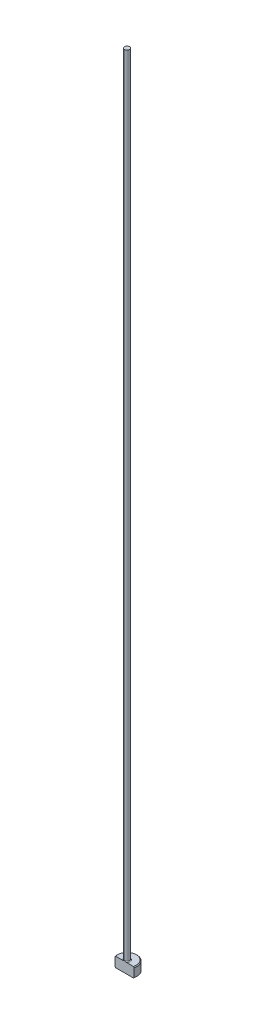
ISO-10303-21;
HEADER;
FILE_DESCRIPTION(('STEP AP214'),'2;1');
FILE_NAME('part.step','',(''),(''),'','','');
FILE_SCHEMA(('AUTOMOTIVE_DESIGN { 1 0 10303 214 1 1 1 1 }'));
ENDSEC;
DATA;
#1=APPLICATION_CONTEXT('core data for automotive mechanical design processes');
#2=APPLICATION_PROTOCOL_DEFINITION('international standard','automotive_design',2000,#1);
#3=PRODUCT_CONTEXT('',#1,'mechanical');
#4=PRODUCT('Part','Part','',(#3));
#5=PRODUCT_RELATED_PRODUCT_CATEGORY('part','',(#4));
#6=PRODUCT_DEFINITION_FORMATION('','',#4);
#7=PRODUCT_DEFINITION_CONTEXT('part definition',#1,'design');
#8=PRODUCT_DEFINITION('design','',#6,#7);
#9=PRODUCT_DEFINITION_SHAPE('','',#8);
#10=(LENGTH_UNIT() NAMED_UNIT(*) SI_UNIT(.MILLI.,.METRE.));
#11=(NAMED_UNIT(*) PLANE_ANGLE_UNIT() SI_UNIT($,.RADIAN.));
#12=(NAMED_UNIT(*) SI_UNIT($,.STERADIAN.) SOLID_ANGLE_UNIT());
#13=UNCERTAINTY_MEASURE_WITH_UNIT(LENGTH_MEASURE(1.E-05),#10,'distance_accuracy_value','');
#14=(GEOMETRIC_REPRESENTATION_CONTEXT(3) GLOBAL_UNCERTAINTY_ASSIGNED_CONTEXT((#13)) GLOBAL_UNIT_ASSIGNED_CONTEXT((#10,
#11,#12)) REPRESENTATION_CONTEXT('',''));
#15=CARTESIAN_POINT('',(0.,0.,0.));
#16=DIRECTION('',(0.,0.,1.));
#17=DIRECTION('',(1.,0.,0.));
#18=AXIS2_PLACEMENT_3D('',#15,#16,#17);
#19=CARTESIAN_POINT('',(0.,0.,0.));
#20=DIRECTION('',(0.,-1.,0.));
#21=DIRECTION('',(0.,0.,-1.));
#22=AXIS2_PLACEMENT_3D('',#19,#20,#21);
#23=PLANE('',#22);
#24=CARTESIAN_POINT('',(0.,0.,0.));
#25=DIRECTION('',(0.,-1.,0.));
#26=DIRECTION('',(0.,0.,-1.));
#27=AXIS2_PLACEMENT_3D('',#24,#25,#26);
#28=CIRCLE('',#27,2.92099999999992);
#29=CARTESIAN_POINT('',(-2.81108554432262,0.,0.793749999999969));
#30=VERTEX_POINT('',#29);
#31=CARTESIAN_POINT('',(2.81108554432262,0.,0.793749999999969));
#32=VERTEX_POINT('',#31);
#33=EDGE_CURVE('E98',#30,#32,#28,.T.);
#34=ORIENTED_EDGE('',*,*,#33,.T.);
#35=DIRECTION('',(-1.,0.,0.));
#36=VECTOR('',#35,1.);
#37=CARTESIAN_POINT('',(-3.07418053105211,0.,0.793749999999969));
#38=LINE('',#37,#36);
#39=EDGE_CURVE('E83',#32,#30,#38,.T.);
#40=ORIENTED_EDGE('',*,*,#39,.T.);
#41=EDGE_LOOP('',(#34,#40));
#42=FACE_BOUND('',#41,.T.);
#43=ADVANCED_FACE('F32',(#42),#23,.T.);
#44=CARTESIAN_POINT('',(0.,259.958771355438,0.));
#45=DIRECTION('',(0.,1.,0.));
#46=DIRECTION('',(0.,0.,1.));
#47=AXIS2_PLACEMENT_3D('',#44,#45,#46);
#48=CYLINDRICAL_SURFACE('',#47,3.17499999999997);
#49=CARTESIAN_POINT('',(0.,2.92100000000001,0.));
#50=DIRECTION('',(0.,1.,0.));
#51=DIRECTION('',(0.,0.,1.));
#52=AXIS2_PLACEMENT_3D('',#49,#50,#51);
#53=CIRCLE('',#52,3.17499999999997);
#54=CARTESIAN_POINT('',(-3.07418053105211,2.92100000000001,0.793749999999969));
#55=VERTEX_POINT('',#54);
#56=CARTESIAN_POINT('',(3.07418053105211,2.92100000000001,0.793749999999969));
#57=VERTEX_POINT('',#56);
#58=EDGE_CURVE('E104',#55,#57,#53,.F.);
#59=ORIENTED_EDGE('',*,*,#58,.T.);
#60=DIRECTION('',(0.,-1.,0.));
#61=VECTOR('',#60,1.);
#62=CARTESIAN_POINT('',(3.07418053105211,254.,0.793749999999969));
#63=LINE('',#62,#61);
#64=CARTESIAN_POINT('',(3.07418053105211,0.254000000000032,0.793749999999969));
#65=VERTEX_POINT('',#64);
#66=EDGE_CURVE('E183',#57,#65,#63,.T.);
#67=ORIENTED_EDGE('',*,*,#66,.T.);
#68=CARTESIAN_POINT('',(0.,0.254000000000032,0.));
#69=DIRECTION('',(0.,-1.,0.));
#70=DIRECTION('',(0.,0.,-1.));
#71=AXIS2_PLACEMENT_3D('',#68,#69,#70);
#72=CIRCLE('',#71,3.17499999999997);
#73=CARTESIAN_POINT('',(-3.07418053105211,0.254000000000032,0.793749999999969));
#74=VERTEX_POINT('',#73);
#75=EDGE_CURVE('E100',#65,#74,#72,.F.);
#76=ORIENTED_EDGE('',*,*,#75,.T.);
#77=DIRECTION('',(0.,-1.,0.));
#78=VECTOR('',#77,1.);
#79=CARTESIAN_POINT('',(-3.07418053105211,254.,0.793749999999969));
#80=LINE('',#79,#78);
#81=EDGE_CURVE('E93',#55,#74,#80,.T.);
#82=ORIENTED_EDGE('',*,*,#81,.F.);
#83=EDGE_LOOP('',(#59,#67,#76,#82));
#84=FACE_BOUND('',#83,.T.);
#85=ADVANCED_FACE('F158',(#84),#48,.T.);
#86=CARTESIAN_POINT('',(-3.17499999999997,3.175,0.));
#87=DIRECTION('',(0.,1.,0.));
#88=DIRECTION('',(0.,0.,1.));
#89=AXIS2_PLACEMENT_3D('',#86,#87,#88);
#90=PLANE('',#89);
#91=CARTESIAN_POINT('',(0.,3.175,0.));
#92=DIRECTION('',(0.,1.,0.));
#93=DIRECTION('',(0.,0.,1.));
#94=AXIS2_PLACEMENT_3D('',#91,#92,#93);
#95=CIRCLE('',#94,2.92099999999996);
#96=CARTESIAN_POINT('',(2.81108554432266,3.175,0.793749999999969));
#97=VERTEX_POINT('',#96);
#98=CARTESIAN_POINT('',(-2.81108554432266,3.175,0.793749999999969));
#99=VERTEX_POINT('',#98);
#100=EDGE_CURVE('E178',#97,#99,#95,.T.);
#101=ORIENTED_EDGE('',*,*,#100,.T.);
#102=DIRECTION('',(1.,0.,0.));
#103=VECTOR('',#102,1.);
#104=CARTESIAN_POINT('',(-3.17499999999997,3.175,0.793749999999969));
#105=LINE('',#104,#103);
#106=CARTESIAN_POINT('',(-0.68391593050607,3.17500000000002,0.793749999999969));
#107=VERTEX_POINT('',#106);
#108=EDGE_CURVE('E57',#99,#107,#105,.T.);
#109=ORIENTED_EDGE('',*,*,#108,.T.);
#110=CARTESIAN_POINT('',(0.,3.175,0.));
#111=DIRECTION('',(0.,1.,0.));
#112=DIRECTION('',(0.,0.,1.));
#113=AXIS2_PLACEMENT_3D('',#110,#111,#112);
#114=CIRCLE('',#113,1.04774999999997);
#115=CARTESIAN_POINT('',(0.683915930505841,3.17500000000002,0.793749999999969));
#116=VERTEX_POINT('',#115);
#117=EDGE_CURVE('E107',#107,#116,#114,.F.);
#118=ORIENTED_EDGE('',*,*,#117,.T.);
#119=EDGE_CURVE('E136',#116,#97,#105,.T.);
#120=ORIENTED_EDGE('',*,*,#119,.T.);
#121=EDGE_LOOP('',(#101,#109,#118,#120));
#122=FACE_BOUND('',#121,.T.);
#123=ADVANCED_FACE('F147',(#122),#90,.T.);
#124=CARTESIAN_POINT('',(0.,3.17499999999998,0.));
#125=DIRECTION('',(0.,-1.,0.));
#126=DIRECTION('',(0.,0.,-1.));
#127=AXIS2_PLACEMENT_3D('',#124,#125,#126);
#128=CONICAL_SURFACE('',#127,2.92099999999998,0.785398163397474);
#129=ORIENTED_EDGE('',*,*,#58,.F.);
#130=CARTESIAN_POINT('',(-6.76654378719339,-0.71694017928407,0.793749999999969));
#131=CARTESIAN_POINT('',(-6.58612847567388,-0.537757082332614,0.793749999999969));
#132=CARTESIAN_POINT('',(-6.40566799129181,-0.358619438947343,0.793749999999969));
#133=CARTESIAN_POINT('',(-6.0445852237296,-0.000434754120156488,0.793749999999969));
#134=CARTESIAN_POINT('',(-5.86396291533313,0.178612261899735,0.793749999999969));
#135=CARTESIAN_POINT('',(-5.50181071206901,0.537283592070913,0.793749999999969));
#136=CARTESIAN_POINT('',(-5.32028015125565,0.716907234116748,0.793749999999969));
#137=CARTESIAN_POINT('',(-4.9570333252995,1.07589430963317,0.793749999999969));
#138=CARTESIAN_POINT('',(-4.77531710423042,1.25525778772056,0.793749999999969));
#139=CARTESIAN_POINT('',(-4.30046081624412,1.72319332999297,0.793749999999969));
#140=CARTESIAN_POINT('',(-4.00708464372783,2.01152633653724,0.793749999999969));
#141=CARTESIAN_POINT('',(-3.56582498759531,2.44302479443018,0.793749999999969));
#142=CARTESIAN_POINT('',(-3.41848369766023,2.58674450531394,0.793749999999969));
#143=CARTESIAN_POINT('',(-3.12328201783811,2.87362456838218,0.793749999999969));
#144=CARTESIAN_POINT('',(-2.97542167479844,3.01678496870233,0.793749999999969));
#145=CARTESIAN_POINT('',(-2.67948713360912,3.30170246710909,0.793749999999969));
#146=CARTESIAN_POINT('',(-2.53141613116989,3.44346288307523,0.793749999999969));
#147=CARTESIAN_POINT('',(-2.23395385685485,3.72569854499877,0.793749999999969));
#148=CARTESIAN_POINT('',(-2.08456216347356,3.86617334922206,0.793749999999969));
#149=CARTESIAN_POINT('',(-1.85887536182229,4.0749451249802,0.793749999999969));
#150=CARTESIAN_POINT('',(-1.7834340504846,4.14416382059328,0.793749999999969));
#151=CARTESIAN_POINT('',(-1.63175147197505,4.28171769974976,0.793749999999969));
#152=CARTESIAN_POINT('',(-1.55551023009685,4.35005291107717,0.793749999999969));
#153=CARTESIAN_POINT('',(-1.40191671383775,4.48538182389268,0.793749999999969));
#154=CARTESIAN_POINT('',(-1.32456505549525,4.55237622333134,0.793749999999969));
#155=CARTESIAN_POINT('',(-1.168148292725,4.68432749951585,0.793749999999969));
#156=CARTESIAN_POINT('',(-1.08908357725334,4.74928483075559,0.793749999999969));
#157=CARTESIAN_POINT('',(-0.978646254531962,4.83605857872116,0.793749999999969));
#158=CARTESIAN_POINT('',(-0.948460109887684,4.85938268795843,0.793749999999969));
#159=CARTESIAN_POINT('',(-0.887614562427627,4.90541183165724,0.793749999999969));
#160=CARTESIAN_POINT('',(-0.856955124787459,4.92811682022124,0.793749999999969));
#161=CARTESIAN_POINT('',(-0.794984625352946,4.97280020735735,0.793749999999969));
#162=CARTESIAN_POINT('',(-0.763672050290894,4.99477651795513,0.793749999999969));
#163=CARTESIAN_POINT('',(-0.700352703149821,5.03770392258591,0.793749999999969));
#164=CARTESIAN_POINT('',(-0.66834596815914,5.05865507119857,0.793749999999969));
#165=CARTESIAN_POINT('',(-0.60459623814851,5.09851389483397,0.793749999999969));
#166=CARTESIAN_POINT('',(-0.57288224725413,5.11746713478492,0.793749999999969));
#167=CARTESIAN_POINT('',(-0.508518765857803,5.15370377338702,0.793749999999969));
#168=CARTESIAN_POINT('',(-0.475868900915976,5.17098649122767,0.793749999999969));
#169=CARTESIAN_POINT('',(-0.376526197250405,5.21937397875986,0.793749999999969));
#170=CARTESIAN_POINT('',(-0.308073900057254,5.24726182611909,0.793749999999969));
#171=CARTESIAN_POINT('',(-0.214532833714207,5.27405975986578,0.793749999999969));
#172=CARTESIAN_POINT('',(-0.191393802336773,5.27981785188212,0.793749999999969));
#173=CARTESIAN_POINT('',(-0.144729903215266,5.28948827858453,0.793749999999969));
#174=CARTESIAN_POINT('',(-0.121204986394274,5.29340037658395,0.793749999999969));
#175=CARTESIAN_POINT('',(-0.050413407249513,5.30201256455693,0.793749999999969));
#176=CARTESIAN_POINT('',(-0.00272310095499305,5.3036512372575,0.793749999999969));
#177=CARTESIAN_POINT('',(0.092081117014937,5.2983358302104,0.793749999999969));
#178=CARTESIAN_POINT('',(0.139195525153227,5.29138976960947,0.793749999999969));
#179=CARTESIAN_POINT('',(0.231925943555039,5.27030742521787,0.793749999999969));
#180=CARTESIAN_POINT('',(0.277534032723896,5.25613809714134,0.793749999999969));
#181=CARTESIAN_POINT('',(0.379024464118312,5.21798849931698,0.793749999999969));
#182=CARTESIAN_POINT('',(0.434273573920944,5.19238048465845,0.793749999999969));
#183=CARTESIAN_POINT('',(0.542067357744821,5.13591410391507,0.793749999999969));
#184=CARTESIAN_POINT('',(0.594605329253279,5.10504346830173,0.793749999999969));
#185=CARTESIAN_POINT('',(0.697964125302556,5.03978970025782,0.793749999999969));
#186=CARTESIAN_POINT('',(0.748769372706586,5.00538227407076,0.793749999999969));
#187=CARTESIAN_POINT('',(0.848768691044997,4.93444453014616,0.793749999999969));
#188=CARTESIAN_POINT('',(0.897964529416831,4.89791667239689,0.793749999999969));
#189=CARTESIAN_POINT('',(1.00110200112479,4.8188872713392,0.793749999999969));
#190=CARTESIAN_POINT('',(1.05489843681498,4.77619738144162,0.793749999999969));
#191=CARTESIAN_POINT('',(1.1614670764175,4.68955385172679,0.793749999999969));
#192=CARTESIAN_POINT('',(1.21423916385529,4.6456000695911,0.793749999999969));
#193=CARTESIAN_POINT('',(1.37147314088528,4.51238432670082,0.793749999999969));
#194=CARTESIAN_POINT('',(1.47481171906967,4.42180042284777,0.793749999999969));
#195=CARTESIAN_POINT('',(1.67990723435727,4.23856991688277,0.793749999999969));
#196=CARTESIAN_POINT('',(1.78166152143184,4.14592038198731,0.793749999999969));
#197=CARTESIAN_POINT('',(1.9840360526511,3.95943864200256,0.793749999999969));
#198=CARTESIAN_POINT('',(2.08465655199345,3.8656067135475,0.793749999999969));
#199=CARTESIAN_POINT('',(2.28470036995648,3.67758310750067,0.793749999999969));
#200=CARTESIAN_POINT('',(2.38412704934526,3.58339499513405,0.793749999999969));
#201=CARTESIAN_POINT('',(2.58246726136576,3.39446890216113,0.793749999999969));
#202=CARTESIAN_POINT('',(2.68138076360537,3.29973088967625,0.793749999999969));
#203=CARTESIAN_POINT('',(2.97740330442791,3.01509017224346,0.793749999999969));
#204=CARTESIAN_POINT('',(3.17395519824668,2.82460855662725,0.793749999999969));
#205=CARTESIAN_POINT('',(3.65457059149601,2.35679110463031,0.793749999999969));
#206=CARTESIAN_POINT('',(3.93817207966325,2.07898169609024,0.793749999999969));
#207=CARTESIAN_POINT('',(4.50454370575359,1.52234859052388,0.793749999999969));
#208=CARTESIAN_POINT('',(4.78731356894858,1.24352461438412,0.793749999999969));
#209=CARTESIAN_POINT('',(5.35306828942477,0.684582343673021,0.793749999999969));
#210=CARTESIAN_POINT('',(5.6360516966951,0.404462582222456,0.793749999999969));
#211=CARTESIAN_POINT('',(6.20156797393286,-0.156054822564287,0.793749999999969));
#212=CARTESIAN_POINT('',(6.48410095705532,-0.436452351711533,0.793749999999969));
#213=CARTESIAN_POINT('',(6.76654378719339,-0.71694017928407,0.793749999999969));
#214=B_SPLINE_CURVE_WITH_KNOTS('',3,(#130,#131,#132,#133,#134,#135,#136,#137,#138,#139,#140,
#141,#142,#143,#144,#145,#146,#147,#148,#149,#150,#151,#152,#153,#154,#155,#156,#157,#158,#159,
#160,#161,#162,#163,#164,#165,#166,#167,#168,#169,#170,#171,#172,#173,#174,#175,#176,#177,#178,
#179,#180,#181,#182,#183,#184,#185,#186,#187,#188,#189,#190,#191,#192,#193,#194,#195,#196,#197,
#198,#199,#200,#201,#202,#203,#204,#205,#206,#207,#208,#209,#210,#211,#212,#213),.UNSPECIFIED.,
.F.,.F.,(4,2,2,2,2,2,2,2,2,2,2,2,2,2,2,2,2,2,2,2,2,2,2,2,2,2,2,2,2,2,2,2,2,2,2,2,2,2,2,2,2,4),
(0.,0.762827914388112,1.5258090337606,2.29194326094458,3.05792523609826,4.29195946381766,
4.90944009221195,5.52686635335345,6.14183419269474,6.75700594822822,7.06415568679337,
7.37129574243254,7.67827152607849,7.98517832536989,8.09961411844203,8.21405837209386,
8.32880631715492,8.44354814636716,8.5543309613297,8.66515873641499,8.88549900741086,
8.95696802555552,9.0284462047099,9.17076254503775,9.3129460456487,9.45578590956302,
9.63799856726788,9.82064200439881,10.0046365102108,10.1884216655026,10.3944233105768,
10.6004482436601,11.0126549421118,11.4254897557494,11.8382297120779,12.2490965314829,
12.6599874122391,13.4811048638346,14.6720966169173,15.8634454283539,17.0579826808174,
18.2521466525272),.UNSPECIFIED.);
#215=EDGE_CURVE('E135',#55,#99,#214,.T.);
#216=ORIENTED_EDGE('',*,*,#215,.T.);
#217=ORIENTED_EDGE('',*,*,#100,.F.);
#218=EDGE_CURVE('E127',#97,#57,#214,.T.);
#219=ORIENTED_EDGE('',*,*,#218,.T.);
#220=EDGE_LOOP('',(#129,#216,#217,#219));
#221=FACE_BOUND('',#220,.T.);
#222=ADVANCED_FACE('F143',(#221),#128,.T.);
#223=CARTESIAN_POINT('',(0.,0.254000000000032,0.));
#224=DIRECTION('',(0.,1.,0.));
#225=DIRECTION('',(0.,0.,1.));
#226=AXIS2_PLACEMENT_3D('',#223,#224,#225);
#227=CONICAL_SURFACE('',#226,3.17499999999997,0.785398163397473);
#228=ORIENTED_EDGE('',*,*,#75,.F.);
#229=CARTESIAN_POINT('',(6.76654378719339,3.89194017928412,0.793749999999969));
#230=CARTESIAN_POINT('',(6.58612847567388,3.71275708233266,0.793749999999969));
#231=CARTESIAN_POINT('',(6.4056679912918,3.53361943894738,0.793749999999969));
#232=CARTESIAN_POINT('',(6.04458522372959,3.17543475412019,0.793749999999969));
#233=CARTESIAN_POINT('',(5.86396291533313,2.9963877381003,0.793749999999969));
#234=CARTESIAN_POINT('',(5.501810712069,2.63771640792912,0.793749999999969));
#235=CARTESIAN_POINT('',(5.32028015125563,2.45809276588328,0.793749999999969));
#236=CARTESIAN_POINT('',(4.95703332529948,2.09910569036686,0.793749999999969));
#237=CARTESIAN_POINT('',(4.7753171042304,1.91974221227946,0.793749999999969));
#238=CARTESIAN_POINT('',(4.3004608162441,1.45180667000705,0.793749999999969));
#239=CARTESIAN_POINT('',(4.00708464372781,1.16347366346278,0.793749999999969));
#240=CARTESIAN_POINT('',(3.56582498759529,0.731975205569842,0.793749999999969));
#241=CARTESIAN_POINT('',(3.41848369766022,0.58825549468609,0.793749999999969));
#242=CARTESIAN_POINT('',(3.1232820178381,0.301375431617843,0.793749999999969));
#243=CARTESIAN_POINT('',(2.97542167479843,0.158215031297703,0.793749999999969));
#244=CARTESIAN_POINT('',(2.67948713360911,-0.12670246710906,0.793749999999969));
#245=CARTESIAN_POINT('',(2.53141613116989,-0.268462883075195,0.793749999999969));
#246=CARTESIAN_POINT('',(2.23395385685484,-0.55069854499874,0.793749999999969));
#247=CARTESIAN_POINT('',(2.08456216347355,-0.691173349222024,0.793749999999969));
#248=CARTESIAN_POINT('',(1.85887536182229,-0.899945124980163,0.793749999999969));
#249=CARTESIAN_POINT('',(1.7834340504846,-0.969163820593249,0.793749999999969));
#250=CARTESIAN_POINT('',(1.63175147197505,-1.10671769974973,0.793749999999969));
#251=CARTESIAN_POINT('',(1.55551023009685,-1.17505291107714,0.793749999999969));
#252=CARTESIAN_POINT('',(1.40191671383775,-1.31038182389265,0.793749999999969));
#253=CARTESIAN_POINT('',(1.32456505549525,-1.3773762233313,0.793749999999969));
#254=CARTESIAN_POINT('',(1.168148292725,-1.50932749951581,0.793749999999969));
#255=CARTESIAN_POINT('',(1.08908357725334,-1.57428483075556,0.793749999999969));
#256=CARTESIAN_POINT('',(0.978646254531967,-1.66105857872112,0.793749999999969));
#257=CARTESIAN_POINT('',(0.948460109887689,-1.68438268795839,0.793749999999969));
#258=CARTESIAN_POINT('',(0.887614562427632,-1.7304118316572,0.793749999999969));
#259=CARTESIAN_POINT('',(0.856955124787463,-1.7531168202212,0.793749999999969));
#260=CARTESIAN_POINT('',(0.79498462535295,-1.79780020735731,0.793749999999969));
#261=CARTESIAN_POINT('',(0.763672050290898,-1.81977651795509,0.793749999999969));
#262=CARTESIAN_POINT('',(0.700352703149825,-1.86270392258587,0.793749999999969));
#263=CARTESIAN_POINT('',(0.668345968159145,-1.88365507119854,0.793749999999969));
#264=CARTESIAN_POINT('',(0.604596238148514,-1.92351389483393,0.793749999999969));
#265=CARTESIAN_POINT('',(0.572882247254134,-1.94246713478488,0.793749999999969));
#266=CARTESIAN_POINT('',(0.508518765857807,-1.97870377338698,0.793749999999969));
#267=CARTESIAN_POINT('',(0.47586890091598,-1.99598649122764,0.793749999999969));
#268=CARTESIAN_POINT('',(0.37652619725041,-2.04437397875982,0.793749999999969));
#269=CARTESIAN_POINT('',(0.30807390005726,-2.07226182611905,0.793749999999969));
#270=CARTESIAN_POINT('',(0.214532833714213,-2.09905975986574,0.793749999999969));
#271=CARTESIAN_POINT('',(0.191393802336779,-2.10481785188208,0.793749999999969));
#272=CARTESIAN_POINT('',(0.144729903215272,-2.11448827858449,0.793749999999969));
#273=CARTESIAN_POINT('',(0.12120498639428,-2.11840037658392,0.793749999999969));
#274=CARTESIAN_POINT('',(0.050413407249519,-2.12701256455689,0.793749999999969));
#275=CARTESIAN_POINT('',(0.00272310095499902,-2.12865123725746,0.793749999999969));
#276=CARTESIAN_POINT('',(-0.0920811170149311,-2.12333583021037,0.793749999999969));
#277=CARTESIAN_POINT('',(-0.139195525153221,-2.11638976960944,0.793749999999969));
#278=CARTESIAN_POINT('',(-0.231925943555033,-2.09530742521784,0.793749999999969));
#279=CARTESIAN_POINT('',(-0.27753403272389,-2.08113809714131,0.793749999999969));
#280=CARTESIAN_POINT('',(-0.379024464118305,-2.04298849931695,0.793749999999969));
#281=CARTESIAN_POINT('',(-0.434273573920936,-2.01738048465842,0.793749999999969));
#282=CARTESIAN_POINT('',(-0.542067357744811,-1.96091410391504,0.793749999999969));
#283=CARTESIAN_POINT('',(-0.594605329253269,-1.9300434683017,0.793749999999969));
#284=CARTESIAN_POINT('',(-0.697964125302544,-1.86478970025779,0.793749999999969));
#285=CARTESIAN_POINT('',(-0.748769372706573,-1.83038227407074,0.793749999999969));
#286=CARTESIAN_POINT('',(-0.848768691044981,-1.75944453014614,0.793749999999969));
#287=CARTESIAN_POINT('',(-0.897964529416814,-1.72291667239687,0.793749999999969));
#288=CARTESIAN_POINT('',(-1.00110200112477,-1.64388727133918,0.793749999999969));
#289=CARTESIAN_POINT('',(-1.05489843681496,-1.60119738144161,0.793749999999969));
#290=CARTESIAN_POINT('',(-1.16146707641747,-1.51455385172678,0.793749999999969));
#291=CARTESIAN_POINT('',(-1.21423916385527,-1.47060006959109,0.793749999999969));
#292=CARTESIAN_POINT('',(-1.37147314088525,-1.33738432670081,0.793749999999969));
#293=CARTESIAN_POINT('',(-1.47481171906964,-1.24680042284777,0.793749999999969));
#294=CARTESIAN_POINT('',(-1.67990723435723,-1.06356991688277,0.793749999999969));
#295=CARTESIAN_POINT('',(-1.7816615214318,-0.970920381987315,0.793749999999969));
#296=CARTESIAN_POINT('',(-1.98403605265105,-0.784438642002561,0.793749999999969));
#297=CARTESIAN_POINT('',(-2.0846565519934,-0.690606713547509,0.793749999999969));
#298=CARTESIAN_POINT('',(-2.28470036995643,-0.502583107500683,0.793749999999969));
#299=CARTESIAN_POINT('',(-2.38412704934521,-0.408394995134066,0.793749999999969));
#300=CARTESIAN_POINT('',(-2.5824672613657,-0.219468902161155,0.793749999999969));
#301=CARTESIAN_POINT('',(-2.68138076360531,-0.124730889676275,0.793749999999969));
#302=CARTESIAN_POINT('',(-2.97740330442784,0.159909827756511,0.793749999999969));
#303=CARTESIAN_POINT('',(-3.17395519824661,0.350391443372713,0.793749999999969));
#304=CARTESIAN_POINT('',(-3.65457059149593,0.818208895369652,0.793749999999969));
#305=CARTESIAN_POINT('',(-3.93817207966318,1.09601830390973,0.793749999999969));
#306=CARTESIAN_POINT('',(-4.50454370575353,1.65265140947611,0.793749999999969));
#307=CARTESIAN_POINT('',(-4.78731356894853,1.93147538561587,0.793749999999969));
#308=CARTESIAN_POINT('',(-5.35306828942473,2.49041765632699,0.793749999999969));
#309=CARTESIAN_POINT('',(-5.63605169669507,2.77053741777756,0.793749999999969));
#310=CARTESIAN_POINT('',(-6.20156797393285,3.33105482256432,0.793749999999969));
#311=CARTESIAN_POINT('',(-6.48410095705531,3.61145235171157,0.793749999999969));
#312=CARTESIAN_POINT('',(-6.76654378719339,3.89194017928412,0.793749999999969));
#313=B_SPLINE_CURVE_WITH_KNOTS('',3,(#229,#230,#231,#232,#233,#234,#235,#236,#237,#238,#239,
#240,#241,#242,#243,#244,#245,#246,#247,#248,#249,#250,#251,#252,#253,#254,#255,#256,#257,#258,
#259,#260,#261,#262,#263,#264,#265,#266,#267,#268,#269,#270,#271,#272,#273,#274,#275,#276,#277,
#278,#279,#280,#281,#282,#283,#284,#285,#286,#287,#288,#289,#290,#291,#292,#293,#294,#295,#296,
#297,#298,#299,#300,#301,#302,#303,#304,#305,#306,#307,#308,#309,#310,#311,#312),.UNSPECIFIED.,
.F.,.F.,(4,2,2,2,2,2,2,2,2,2,2,2,2,2,2,2,2,2,2,2,2,2,2,2,2,2,2,2,2,2,2,2,2,2,2,2,2,2,2,2,2,4),
(0.,0.762827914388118,1.52580903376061,2.29194326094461,3.05792523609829,4.29195946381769,
4.90944009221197,5.52686635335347,6.14183419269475,6.75700594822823,7.06415568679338,
7.37129574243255,7.6782715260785,7.98517832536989,8.09961411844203,8.21405837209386,
8.32880631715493,8.44354814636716,8.5543309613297,8.665158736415,8.88549900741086,
8.95696802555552,9.0284462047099,9.17076254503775,9.3129460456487,9.45578590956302,
9.63799856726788,9.8206420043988,10.0046365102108,10.1884216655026,10.3944233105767,
10.6004482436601,11.0126549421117,11.4254897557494,11.8382297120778,12.2490965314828,
12.6599874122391,13.4811048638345,14.6720966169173,15.8634454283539,17.0579826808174,
18.2521466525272),.UNSPECIFIED.);
#314=EDGE_CURVE('E86',#65,#32,#313,.T.);
#315=ORIENTED_EDGE('',*,*,#314,.T.);
#316=ORIENTED_EDGE('',*,*,#33,.F.);
#317=EDGE_CURVE('E89',#30,#74,#313,.T.);
#318=ORIENTED_EDGE('',*,*,#317,.T.);
#319=EDGE_LOOP('',(#228,#315,#316,#318));
#320=FACE_BOUND('',#319,.T.);
#321=ADVANCED_FACE('F97',(#320),#227,.T.);
#322=CARTESIAN_POINT('',(0.,3.42900000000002,0.));
#323=DIRECTION('',(0.,1.,0.));
#324=DIRECTION('',(0.,0.,1.));
#325=AXIS2_PLACEMENT_3D('',#322,#323,#324);
#326=TOROIDAL_SURFACE('',#325,1.04774999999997,0.254);
#327=CARTESIAN_POINT('',(0.,3.42900000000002,0.793749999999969));
#328=CARTESIAN_POINT('',(1.00594079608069E-09,3.42900059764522,0.793749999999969));
#329=CARTESIAN_POINT('',(8.25543157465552E-08,3.42900119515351,0.793749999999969));
#330=CARTESIAN_POINT('',(3.59845202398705E-07,3.42900236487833,0.793749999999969));
#331=CARTESIAN_POINT('',(5.56611928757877E-07,3.42900293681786,0.793749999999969));
#332=CARTESIAN_POINT('',(1.03793284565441E-06,3.4290040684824,0.793749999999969));
#333=CARTESIAN_POINT('',(1.32565590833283E-06,3.42900462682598,0.793749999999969));
#334=CARTESIAN_POINT('',(1.96199956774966E-06,3.42900570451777,0.793749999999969));
#335=CARTESIAN_POINT('',(2.31046733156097E-06,3.42900622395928,0.793749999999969));
#336=CARTESIAN_POINT('',(3.51238455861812E-06,3.42900787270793,0.793749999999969));
#337=CARTESIAN_POINT('',(4.44738387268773E-06,3.42900894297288,0.793749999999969));
#338=CARTESIAN_POINT('',(6.43338758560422E-06,3.42901092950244,0.793749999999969));
#339=CARTESIAN_POINT('',(7.48242245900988E-06,3.42901184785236,0.793749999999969));
#340=CARTESIAN_POINT('',(1.1352686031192E-05,3.42901504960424,0.793749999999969));
#341=CARTESIAN_POINT('',(1.43190067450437E-05,3.42901716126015,0.793749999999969));
#342=CARTESIAN_POINT('',(2.0344879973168E-05,3.42902083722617,0.793749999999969));
#343=CARTESIAN_POINT('',(2.33909441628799E-05,3.42902242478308,0.793749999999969));
#344=CARTESIAN_POINT('',(3.56627691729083E-05,3.42902869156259,0.793749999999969));
#345=CARTESIAN_POINT('',(4.4989192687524E-05,3.42903316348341,0.793749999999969));
#346=CARTESIAN_POINT('',(6.2853777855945E-05,3.42904079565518,0.793749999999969));
#347=CARTESIAN_POINT('',(7.13510645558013E-05,3.42904404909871,0.793749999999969));
#348=CARTESIAN_POINT('',(0.000129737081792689,3.42906834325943,0.793749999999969));
#349=CARTESIAN_POINT('',(0.00017577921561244,3.42909753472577,0.793749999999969));
#350=CARTESIAN_POINT('',(0.000350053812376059,3.42920359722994,0.793749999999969));
#351=CARTESIAN_POINT('',(0.00048099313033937,3.42927442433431,0.793749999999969));
#352=CARTESIAN_POINT('',(0.000972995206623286,3.42954494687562,0.793749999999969));
#353=CARTESIAN_POINT('',(0.00133127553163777,3.4297509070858,0.793749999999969));
#354=CARTESIAN_POINT('',(0.00275914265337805,3.43056728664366,0.793749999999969));
#355=CARTESIAN_POINT('',(0.00383182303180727,3.43117068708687,0.793749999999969));
#356=CARTESIAN_POINT('',(0.0249852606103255,3.44307504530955,0.793749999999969));
#357=CARTESIAN_POINT('',(0.0450341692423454,3.45445024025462,0.793749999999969));
#358=CARTESIAN_POINT('',(0.0846093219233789,3.47663493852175,0.793749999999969));
#359=CARTESIAN_POINT('',(0.10413206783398,3.48745096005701,0.793749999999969));
#360=CARTESIAN_POINT('',(0.145314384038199,3.50987127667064,0.793749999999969));
#361=CARTESIAN_POINT('',(0.166990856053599,3.52144503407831,0.793749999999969));
#362=CARTESIAN_POINT('',(0.210829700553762,3.54412234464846,0.793749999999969));
#363=CARTESIAN_POINT('',(0.232994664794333,3.55522089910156,0.793749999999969));
#364=CARTESIAN_POINT('',(0.289745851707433,3.58237702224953,0.793749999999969));
#365=CARTESIAN_POINT('',(0.324598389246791,3.59788963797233,0.793749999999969));
#366=CARTESIAN_POINT('',(0.394732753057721,3.62578193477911,0.793749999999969));
#367=CARTESIAN_POINT('',(0.429990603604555,3.63822002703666,0.793749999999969));
#368=CARTESIAN_POINT('',(0.486020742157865,3.65466140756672,0.793749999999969));
#369=CARTESIAN_POINT('',(0.506403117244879,3.65997735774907,0.793749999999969));
#370=CARTESIAN_POINT('',(0.547581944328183,3.66916489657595,0.793749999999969));
#371=CARTESIAN_POINT('',(0.568379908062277,3.67302947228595,0.793749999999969));
#372=CARTESIAN_POINT('',(0.632823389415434,3.68222555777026,0.793749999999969));
#373=CARTESIAN_POINT('',(0.677005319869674,3.6846711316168,0.793749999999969));
#374=CARTESIAN_POINT('',(0.74175190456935,3.68045811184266,0.793749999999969));
#375=CARTESIAN_POINT('',(0.762598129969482,3.67788777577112,0.793749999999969));
#376=CARTESIAN_POINT('',(0.803620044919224,3.66996519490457,0.793749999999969));
#377=CARTESIAN_POINT('',(0.823799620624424,3.66463419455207,0.793749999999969));
#378=CARTESIAN_POINT('',(0.863382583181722,3.65071566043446,0.793749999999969));
#379=CARTESIAN_POINT('',(0.882769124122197,3.64207900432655,0.793749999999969));
#380=CARTESIAN_POINT('',(0.919550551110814,3.62121223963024,0.793749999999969));
#381=CARTESIAN_POINT('',(0.936947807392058,3.6089864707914,0.793749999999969));
#382=CARTESIAN_POINT('',(0.962807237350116,3.5859668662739,0.793749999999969));
#383=CARTESIAN_POINT('',(0.972229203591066,3.57624640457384,0.793749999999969));
#384=CARTESIAN_POINT('',(0.989372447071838,3.55540033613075,0.793749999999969));
#385=CARTESIAN_POINT('',(0.997095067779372,3.54427585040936,0.793749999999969));
#386=CARTESIAN_POINT('',(1.01049428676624,3.52073386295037,0.793749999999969));
#387=CARTESIAN_POINT('',(1.01615519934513,3.50830733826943,0.793749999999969));
#388=CARTESIAN_POINT('',(1.02498233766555,3.48259444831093,0.793749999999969));
#389=CARTESIAN_POINT('',(1.02815025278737,3.46930867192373,0.793749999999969));
#390=CARTESIAN_POINT('',(1.03155096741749,3.44397291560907,0.793749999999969));
#391=CARTESIAN_POINT('',(1.03208709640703,3.43196305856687,0.793749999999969));
#392=CARTESIAN_POINT('',(1.03101637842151,3.40804163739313,0.793749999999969));
#393=CARTESIAN_POINT('',(1.02941018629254,3.39613004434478,0.793749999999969));
#394=CARTESIAN_POINT('',(1.02428560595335,3.37336758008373,0.793749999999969));
#395=CARTESIAN_POINT('',(1.02086846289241,3.36249356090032,0.793749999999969));
#396=CARTESIAN_POINT('',(1.01236081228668,3.34142542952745,0.793749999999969));
#397=CARTESIAN_POINT('',(1.00727011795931,3.33123139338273,0.793749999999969));
#398=CARTESIAN_POINT('',(0.995273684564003,3.31111130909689,0.793749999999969));
#399=CARTESIAN_POINT('',(0.988275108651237,3.30124089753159,0.793749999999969));
#400=CARTESIAN_POINT('',(0.972923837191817,3.28262339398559,0.793749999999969));
#401=CARTESIAN_POINT('',(0.964570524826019,3.27387681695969,0.793749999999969));
#402=CARTESIAN_POINT('',(0.943078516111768,3.25417715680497,0.793749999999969));
#403=CARTESIAN_POINT('',(0.929393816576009,3.24381776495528,0.793749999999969));
#404=CARTESIAN_POINT('',(0.900512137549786,3.2254571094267,0.793749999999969));
#405=CARTESIAN_POINT('',(0.885311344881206,3.21746200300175,0.793749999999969));
#406=CARTESIAN_POINT('',(0.848269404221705,3.20122250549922,0.793749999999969));
#407=CARTESIAN_POINT('',(0.826012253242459,3.19393028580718,0.793749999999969));
#408=CARTESIAN_POINT('',(0.780723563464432,3.18300053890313,0.793749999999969));
#409=CARTESIAN_POINT('',(0.75769381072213,3.17935511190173,0.793749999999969));
#410=CARTESIAN_POINT('',(0.699883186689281,3.17409624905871,0.793749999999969));
#411=CARTESIAN_POINT('',(0.664934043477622,3.17438476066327,0.793749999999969));
#412=CARTESIAN_POINT('',(0.594912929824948,3.18030030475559,0.793749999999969));
#413=CARTESIAN_POINT('',(0.559851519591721,3.18602988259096,0.793749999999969));
#414=CARTESIAN_POINT('',(0.482838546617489,3.20336698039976,0.793749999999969));
#415=CARTESIAN_POINT('',(0.44112931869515,3.2160134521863,0.793749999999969));
#416=CARTESIAN_POINT('',(0.359235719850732,3.24555160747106,0.793749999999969));
#417=CARTESIAN_POINT('',(0.319054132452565,3.26245064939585,0.793749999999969));
#418=CARTESIAN_POINT('',(0.243269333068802,3.29746035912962,0.793749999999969));
#419=CARTESIAN_POINT('',(0.207563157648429,3.31535360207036,0.793749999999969));
#420=CARTESIAN_POINT('',(0.137215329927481,3.35230149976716,0.793749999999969));
#421=CARTESIAN_POINT('',(0.102566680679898,3.37134307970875,0.793749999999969));
#422=CARTESIAN_POINT('',(0.058815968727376,3.39581599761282,0.793749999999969));
#423=CARTESIAN_POINT('',(0.0495777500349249,3.4010080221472,0.793749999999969));
#424=CARTESIAN_POINT('',(0.0342003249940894,3.40966841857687,0.793749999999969));
#425=CARTESIAN_POINT('',(0.0280584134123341,3.41313227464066,0.793749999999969));
#426=CARTESIAN_POINT('',(0.0162490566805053,3.41981335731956,0.793749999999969));
#427=CARTESIAN_POINT('',(0.0105810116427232,3.4230293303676,0.793749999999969));
#428=CARTESIAN_POINT('',(0.00384046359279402,3.42682478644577,0.793749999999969));
#429=CARTESIAN_POINT('',(0.00277621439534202,3.42742318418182,0.793749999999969));
#430=CARTESIAN_POINT('',(0.00135061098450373,3.42823816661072,0.793749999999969));
#431=CARTESIAN_POINT('',(0.000986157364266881,3.42844769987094,0.793749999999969));
#432=CARTESIAN_POINT('',(0.000486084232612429,3.42872264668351,0.793749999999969));
#433=CARTESIAN_POINT('',(0.000353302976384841,3.42879446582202,0.793749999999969));
#434=CARTESIAN_POINT('',(0.000176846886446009,3.42890187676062,0.793749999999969));
#435=CARTESIAN_POINT('',(0.000130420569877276,3.42893131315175,0.793749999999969));
#436=CARTESIAN_POINT('',(7.15678594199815E-05,3.42895575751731,0.793749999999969));
#437=CARTESIAN_POINT('',(6.30330597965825E-05,3.42895901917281,0.793749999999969));
#438=CARTESIAN_POINT('',(4.50899390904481E-05,3.42896668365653,0.793749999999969));
#439=CARTESIAN_POINT('',(3.5723396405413E-05,3.42897118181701,0.793749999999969));
#440=CARTESIAN_POINT('',(2.34063299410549E-05,3.42897748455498,0.793749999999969));
#441=CARTESIAN_POINT('',(2.03534438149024E-05,3.42897907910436,0.793749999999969));
#442=CARTESIAN_POINT('',(1.43153651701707E-05,3.42898277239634,0.793749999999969));
#443=CARTESIAN_POINT('',(1.13438162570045E-05,3.42898489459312,0.793749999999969));
#444=CARTESIAN_POINT('',(7.46894567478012E-06,3.42898811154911,0.793749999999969));
#445=CARTESIAN_POINT('',(6.41931601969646E-06,3.42898903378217,0.793749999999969));
#446=CARTESIAN_POINT('',(4.43292994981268E-06,3.42899102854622,0.793749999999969));
#447=CARTESIAN_POINT('',(3.49816033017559E-06,3.42899210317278,0.793749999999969));
#448=CARTESIAN_POINT('',(2.29751703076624E-06,3.42899375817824,0.793749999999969));
#449=CARTESIAN_POINT('',(1.94960797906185E-06,3.42899427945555,0.793749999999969));
#450=CARTESIAN_POINT('',(1.3146993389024E-06,3.42899536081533,0.793749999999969));
#451=CARTESIAN_POINT('',(1.02785383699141E-06,3.42899592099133,0.793749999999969));
#452=CARTESIAN_POINT('',(5.48672660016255E-07,3.42899705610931,0.793749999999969));
#453=CARTESIAN_POINT('',(3.53146209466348E-07,3.42899762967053,0.793749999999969));
#454=CARTESIAN_POINT('',(7.8821997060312E-08,3.42899880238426,0.793749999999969));
#455=CARTESIAN_POINT('',(-1.0077821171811E-09,3.42899940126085,0.793749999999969));
#456=CARTESIAN_POINT('',(0.,3.42900000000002,0.793749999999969));
#457=B_SPLINE_CURVE_WITH_KNOTS('',3,(#327,#328,#329,#330,#331,#332,#333,#334,#335,#336,#337,
#338,#339,#340,#341,#342,#343,#344,#345,#346,#347,#348,#349,#350,#351,#352,#353,#354,#355,#356,
#357,#358,#359,#360,#361,#362,#363,#364,#365,#366,#367,#368,#369,#370,#371,#372,#373,#374,#375,
#376,#377,#378,#379,#380,#381,#382,#383,#384,#385,#386,#387,#388,#389,#390,#391,#392,#393,#394,
#395,#396,#397,#398,#399,#400,#401,#402,#403,#404,#405,#406,#407,#408,#409,#410,#411,#412,#413,
#414,#415,#416,#417,#418,#419,#420,#421,#422,#423,#424,#425,#426,#427,#428,#429,#430,#431,#432,
#433,#434,#435,#436,#437,#438,#439,#440,#441,#442,#443,#444,#445,#446,#447,#448,#449,#450,#451,
#452,#453,#454,#455,#456),.UNSPECIFIED.,.T.,.F.,(4,2,2,2,2,2,2,2,2,2,2,2,2,2,2,2,2,2,2,2,2,2,2,
2,2,2,2,2,2,2,2,2,2,2,2,2,2,2,2,2,2,2,2,2,2,2,2,2,2,2,2,2,2,2,2,2,2,2,2,2,2,2,2,2,4),(0.,
1.79102258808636E-06,3.59821320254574E-06,5.47699485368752E-06,7.35111599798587E-06,
1.15941335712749E-05,1.57729445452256E-05,2.66507184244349E-05,3.69462646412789E-05,
6.79598041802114E-05,9.52269114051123E-05,0.000257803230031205,0.000705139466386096,
0.00194403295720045,0.00563714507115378,0.0747790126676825,0.141736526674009,0.215448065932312,
0.289804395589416,0.404169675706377,0.516158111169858,0.579297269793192,0.642737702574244,
0.774347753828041,0.837211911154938,0.899599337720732,0.962952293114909,1.02622895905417,
1.06668820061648,1.10711534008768,1.14784392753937,1.18854489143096,1.22442273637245,
1.26028961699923,1.29433514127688,1.32838446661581,1.36454119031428,1.40071442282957,
1.45192108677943,1.5032599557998,1.57313432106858,1.64285699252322,1.74712810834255,
1.85340420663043,1.98380168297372,2.11442636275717,2.23419481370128,2.35279155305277,
2.3845831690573,2.40573793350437,2.42528567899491,2.42894945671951,2.43020971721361,
2.4306633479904,2.43082727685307,2.4308546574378,2.43088581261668,2.43089613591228,
2.43090704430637,2.4309112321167,2.43091548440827,2.4309173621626,2.43091924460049,
2.43092105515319,2.43092284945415),.UNSPECIFIED.);
#458=CARTESIAN_POINT('',(0.,3.42900000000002,0.793749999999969));
#459=VERTEX_POINT('',#458);
#460=EDGE_CURVE('E11',#116,#459,#457,.T.);
#461=ORIENTED_EDGE('',*,*,#460,.F.);
#462=ORIENTED_EDGE('',*,*,#117,.F.);
#463=CARTESIAN_POINT('',(0.,3.42900000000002,0.793749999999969));
#464=CARTESIAN_POINT('',(-1.00594083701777E-09,3.42899940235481,0.793749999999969));
#465=CARTESIAN_POINT('',(-8.25543157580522E-08,3.42899880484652,0.793749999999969));
#466=CARTESIAN_POINT('',(-3.59845202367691E-07,3.4289976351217,0.793749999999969));
#467=CARTESIAN_POINT('',(-5.56611928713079E-07,3.42899706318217,0.793749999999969));
#468=CARTESIAN_POINT('',(-1.03793284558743E-06,3.42899593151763,0.793749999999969));
#469=CARTESIAN_POINT('',(-1.32565590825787E-06,3.42899537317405,0.793749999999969));
#470=CARTESIAN_POINT('',(-1.96199956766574E-06,3.42899429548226,0.793749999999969));
#471=CARTESIAN_POINT('',(-2.31046733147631E-06,3.42899377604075,0.793749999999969));
#472=CARTESIAN_POINT('',(-3.51238455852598E-06,3.4289921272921,0.793749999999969));
#473=CARTESIAN_POINT('',(-4.4473838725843E-06,3.42899105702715,0.793749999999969));
#474=CARTESIAN_POINT('',(-6.43338758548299E-06,3.42898907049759,0.793749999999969));
#475=CARTESIAN_POINT('',(-7.48242245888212E-06,3.42898815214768,0.793749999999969));
#476=CARTESIAN_POINT('',(-1.1352686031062E-05,3.42898495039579,0.793749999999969));
#477=CARTESIAN_POINT('',(-1.43190067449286E-05,3.42898283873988,0.793749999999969));
#478=CARTESIAN_POINT('',(-2.03448799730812E-05,3.42897916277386,0.793749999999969));
#479=CARTESIAN_POINT('',(-2.33909441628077E-05,3.42897757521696,0.793749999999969));
#480=CARTESIAN_POINT('',(-3.56627691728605E-05,3.42897130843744,0.793749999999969));
#481=CARTESIAN_POINT('',(-4.49891926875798E-05,3.42896683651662,0.793749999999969));
#482=CARTESIAN_POINT('',(-6.28537778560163E-05,3.42895920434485,0.793749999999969));
#483=CARTESIAN_POINT('',(-7.13510645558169E-05,3.42895595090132,0.793749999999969));
#484=CARTESIAN_POINT('',(-0.000129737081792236,3.4289316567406,0.793749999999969));
#485=CARTESIAN_POINT('',(-0.000175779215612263,3.42890246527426,0.793749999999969));
#486=CARTESIAN_POINT('',(-0.000350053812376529,3.42879640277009,0.793749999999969));
#487=CARTESIAN_POINT('',(-0.000480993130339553,3.42872557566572,0.793749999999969));
#488=CARTESIAN_POINT('',(-0.000972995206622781,3.42845505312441,0.793749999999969));
#489=CARTESIAN_POINT('',(-0.00133127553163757,3.42824909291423,0.793749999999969));
#490=CARTESIAN_POINT('',(-0.00275914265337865,3.42743271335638,0.793749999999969));
#491=CARTESIAN_POINT('',(-0.00383182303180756,3.42682931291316,0.793749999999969));
#492=CARTESIAN_POINT('',(-0.0249852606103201,3.41492495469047,0.793749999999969));
#493=CARTESIAN_POINT('',(-0.045034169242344,3.40354975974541,0.793749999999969));
#494=CARTESIAN_POINT('',(-0.0846093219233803,3.38136506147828,0.793749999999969));
#495=CARTESIAN_POINT('',(-0.104132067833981,3.37054903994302,0.793749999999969));
#496=CARTESIAN_POINT('',(-0.145314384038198,3.34812872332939,0.793749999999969));
#497=CARTESIAN_POINT('',(-0.166990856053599,3.33655496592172,0.793749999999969));
#498=CARTESIAN_POINT('',(-0.210829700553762,3.31387765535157,0.793749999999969));
#499=CARTESIAN_POINT('',(-0.232994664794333,3.30277910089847,0.793749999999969));
#500=CARTESIAN_POINT('',(-0.289745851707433,3.2756229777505,0.793749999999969));
#501=CARTESIAN_POINT('',(-0.324598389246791,3.2601103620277,0.793749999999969));
#502=CARTESIAN_POINT('',(-0.394732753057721,3.23221806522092,0.793749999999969));
#503=CARTESIAN_POINT('',(-0.429990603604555,3.21977997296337,0.793749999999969));
#504=CARTESIAN_POINT('',(-0.486020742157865,3.20333859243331,0.793749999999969));
#505=CARTESIAN_POINT('',(-0.506403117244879,3.19802264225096,0.793749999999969));
#506=CARTESIAN_POINT('',(-0.547581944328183,3.18883510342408,0.793749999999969));
#507=CARTESIAN_POINT('',(-0.568379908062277,3.18497052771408,0.793749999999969));
#508=CARTESIAN_POINT('',(-0.632823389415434,3.17577444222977,0.793749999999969));
#509=CARTESIAN_POINT('',(-0.677005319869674,3.17332886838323,0.793749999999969));
#510=CARTESIAN_POINT('',(-0.74175190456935,3.17754188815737,0.793749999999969));
#511=CARTESIAN_POINT('',(-0.762598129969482,3.18011222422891,0.793749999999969));
#512=CARTESIAN_POINT('',(-0.803620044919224,3.18803480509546,0.793749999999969));
#513=CARTESIAN_POINT('',(-0.823799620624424,3.19336580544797,0.793749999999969));
#514=CARTESIAN_POINT('',(-0.863382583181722,3.20728433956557,0.793749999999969));
#515=CARTESIAN_POINT('',(-0.882769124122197,3.21592099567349,0.793749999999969));
#516=CARTESIAN_POINT('',(-0.919550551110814,3.23678776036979,0.793749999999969));
#517=CARTESIAN_POINT('',(-0.936947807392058,3.24901352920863,0.793749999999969));
#518=CARTESIAN_POINT('',(-0.962807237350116,3.27203313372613,0.793749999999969));
#519=CARTESIAN_POINT('',(-0.972229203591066,3.28175359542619,0.793749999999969));
#520=CARTESIAN_POINT('',(-0.989372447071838,3.30259966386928,0.793749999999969));
#521=CARTESIAN_POINT('',(-0.997095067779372,3.31372414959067,0.793749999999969));
#522=CARTESIAN_POINT('',(-1.01049428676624,3.33726613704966,0.793749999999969));
#523=CARTESIAN_POINT('',(-1.01615519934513,3.3496926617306,0.793749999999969));
#524=CARTESIAN_POINT('',(-1.02498233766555,3.3754055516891,0.793749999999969));
#525=CARTESIAN_POINT('',(-1.02815025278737,3.3886913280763,0.793749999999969));
#526=CARTESIAN_POINT('',(-1.03155096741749,3.41402708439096,0.793749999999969));
#527=CARTESIAN_POINT('',(-1.03208709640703,3.42603694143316,0.793749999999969));
#528=CARTESIAN_POINT('',(-1.03101637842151,3.4499583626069,0.793749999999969));
#529=CARTESIAN_POINT('',(-1.02941018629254,3.46186995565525,0.793749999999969));
#530=CARTESIAN_POINT('',(-1.02428560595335,3.4846324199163,0.793749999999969));
#531=CARTESIAN_POINT('',(-1.02086846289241,3.49550643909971,0.793749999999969));
#532=CARTESIAN_POINT('',(-1.01236081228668,3.51657457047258,0.793749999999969));
#533=CARTESIAN_POINT('',(-1.00727011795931,3.5267686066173,0.793749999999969));
#534=CARTESIAN_POINT('',(-0.995273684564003,3.54688869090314,0.793749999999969));
#535=CARTESIAN_POINT('',(-0.988275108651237,3.55675910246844,0.793749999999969));
#536=CARTESIAN_POINT('',(-0.972923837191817,3.57537660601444,0.793749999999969));
#537=CARTESIAN_POINT('',(-0.964570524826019,3.58412318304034,0.793749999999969));
#538=CARTESIAN_POINT('',(-0.943078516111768,3.60382284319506,0.793749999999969));
#539=CARTESIAN_POINT('',(-0.92939381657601,3.61418223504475,0.793749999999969));
#540=CARTESIAN_POINT('',(-0.900512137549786,3.63254289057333,0.793749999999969));
#541=CARTESIAN_POINT('',(-0.885311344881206,3.64053799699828,0.793749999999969));
#542=CARTESIAN_POINT('',(-0.848269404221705,3.65677749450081,0.793749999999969));
#543=CARTESIAN_POINT('',(-0.826012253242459,3.66406971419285,0.793749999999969));
#544=CARTESIAN_POINT('',(-0.780723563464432,3.6749994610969,0.793749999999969));
#545=CARTESIAN_POINT('',(-0.75769381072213,3.6786448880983,0.793749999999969));
#546=CARTESIAN_POINT('',(-0.699883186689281,3.68390375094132,0.793749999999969));
#547=CARTESIAN_POINT('',(-0.664934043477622,3.68361523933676,0.793749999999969));
#548=CARTESIAN_POINT('',(-0.594912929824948,3.67769969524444,0.793749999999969));
#549=CARTESIAN_POINT('',(-0.559851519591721,3.67197011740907,0.793749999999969));
#550=CARTESIAN_POINT('',(-0.482838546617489,3.65463301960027,0.793749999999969));
#551=CARTESIAN_POINT('',(-0.44112931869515,3.64198654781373,0.793749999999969));
#552=CARTESIAN_POINT('',(-0.359235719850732,3.61244839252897,0.793749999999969));
#553=CARTESIAN_POINT('',(-0.319054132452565,3.59554935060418,0.793749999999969));
#554=CARTESIAN_POINT('',(-0.243269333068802,3.56053964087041,0.793749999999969));
#555=CARTESIAN_POINT('',(-0.207563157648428,3.54264639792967,0.793749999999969));
#556=CARTESIAN_POINT('',(-0.137215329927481,3.50569850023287,0.793749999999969));
#557=CARTESIAN_POINT('',(-0.102566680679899,3.48665692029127,0.793749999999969));
#558=CARTESIAN_POINT('',(-0.0588159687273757,3.46218400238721,0.793749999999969));
#559=CARTESIAN_POINT('',(-0.0495777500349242,3.45699197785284,0.793749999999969));
#560=CARTESIAN_POINT('',(-0.0342003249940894,3.44833158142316,0.793749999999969));
#561=CARTESIAN_POINT('',(-0.0280584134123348,3.44486772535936,0.793749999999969));
#562=CARTESIAN_POINT('',(-0.0162490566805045,3.43818664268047,0.793749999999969));
#563=CARTESIAN_POINT('',(-0.0105810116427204,3.43497066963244,0.793749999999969));
#564=CARTESIAN_POINT('',(-0.00384046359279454,3.43117521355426,0.793749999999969));
#565=CARTESIAN_POINT('',(-0.00277621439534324,3.43057681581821,0.793749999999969));
#566=CARTESIAN_POINT('',(-0.00135061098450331,3.42976183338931,0.793749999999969));
#567=CARTESIAN_POINT('',(-0.000986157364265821,3.42955230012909,0.793749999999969));
#568=CARTESIAN_POINT('',(-0.000486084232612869,3.42927735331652,0.793749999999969));
#569=CARTESIAN_POINT('',(-0.000353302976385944,3.42920553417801,0.793749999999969));
#570=CARTESIAN_POINT('',(-0.000176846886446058,3.42909812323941,0.793749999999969));
#571=CARTESIAN_POINT('',(-0.00013042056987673,3.42906868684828,0.793749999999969));
#572=CARTESIAN_POINT('',(-7.15678594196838E-05,3.42904424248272,0.793749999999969));
#573=CARTESIAN_POINT('',(-6.30330597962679E-05,3.42904098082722,0.793749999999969));
#574=CARTESIAN_POINT('',(-4.50899390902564E-05,3.4290333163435,0.793749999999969));
#575=CARTESIAN_POINT('',(-3.57233964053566E-05,3.42902881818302,0.793749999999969));
#576=CARTESIAN_POINT('',(-2.34063299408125E-05,3.42902251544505,0.793749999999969));
#577=CARTESIAN_POINT('',(-2.03534438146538E-05,3.42902092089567,0.793749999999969));
#578=CARTESIAN_POINT('',(-1.43153651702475E-05,3.42901722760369,0.793749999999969));
#579=CARTESIAN_POINT('',(-1.13438162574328E-05,3.42901510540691,0.793749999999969));
#580=CARTESIAN_POINT('',(-7.46894567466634E-06,3.42901188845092,0.793749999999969));
#581=CARTESIAN_POINT('',(-6.41931601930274E-06,3.42901096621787,0.793749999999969));
#582=CARTESIAN_POINT('',(-4.432929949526E-06,3.42900897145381,0.793749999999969));
#583=CARTESIAN_POINT('',(-3.49816033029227E-06,3.42900789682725,0.793749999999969));
#584=CARTESIAN_POINT('',(-2.29751703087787E-06,3.4290062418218,0.793749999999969));
#585=CARTESIAN_POINT('',(-1.94960797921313E-06,3.42900572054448,0.793749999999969));
#586=CARTESIAN_POINT('',(-1.31469933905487E-06,3.4290046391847,0.793749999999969));
#587=CARTESIAN_POINT('',(-1.02785383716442E-06,3.4290040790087,0.793749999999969));
#588=CARTESIAN_POINT('',(-5.48672660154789E-07,3.42900294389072,0.793749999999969));
#589=CARTESIAN_POINT('',(-3.53146209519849E-07,3.4290023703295,0.793749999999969));
#590=CARTESIAN_POINT('',(-7.88219969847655E-08,3.42900119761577,0.793749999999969));
#591=CARTESIAN_POINT('',(1.00778215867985E-09,3.42900059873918,0.793749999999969));
#592=CARTESIAN_POINT('',(0.,3.42900000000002,0.793749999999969));
#593=B_SPLINE_CURVE_WITH_KNOTS('',3,(#463,#464,#465,#466,#467,#468,#469,#470,#471,#472,#473,
#474,#475,#476,#477,#478,#479,#480,#481,#482,#483,#484,#485,#486,#487,#488,#489,#490,#491,#492,
#493,#494,#495,#496,#497,#498,#499,#500,#501,#502,#503,#504,#505,#506,#507,#508,#509,#510,#511,
#512,#513,#514,#515,#516,#517,#518,#519,#520,#521,#522,#523,#524,#525,#526,#527,#528,#529,#530,
#531,#532,#533,#534,#535,#536,#537,#538,#539,#540,#541,#542,#543,#544,#545,#546,#547,#548,#549,
#550,#551,#552,#553,#554,#555,#556,#557,#558,#559,#560,#561,#562,#563,#564,#565,#566,#567,#568,
#569,#570,#571,#572,#573,#574,#575,#576,#577,#578,#579,#580,#581,#582,#583,#584,#585,#586,#587,
#588,#589,#590,#591,#592),.UNSPECIFIED.,.T.,.F.,(4,2,2,2,2,2,2,2,2,2,2,2,2,2,2,2,2,2,2,2,2,2,2,
2,2,2,2,2,2,2,2,2,2,2,2,2,2,2,2,2,2,2,2,2,2,2,2,2,2,2,2,2,2,2,2,2,2,2,2,2,2,2,2,2,4),(0.,
1.79102258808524E-06,3.59821320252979E-06,5.47699485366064E-06,7.3511159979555E-06,
1.15941335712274E-05,1.57729445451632E-05,2.6650718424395E-05,3.69462646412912E-05,
6.79598041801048E-05,9.52269114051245E-05,0.000257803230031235,0.000705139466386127,
0.00194403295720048,0.00563714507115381,0.0747790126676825,0.141736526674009,0.215448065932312,
0.289804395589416,0.404169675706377,0.516158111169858,0.579297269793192,0.642737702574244,
0.774347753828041,0.837211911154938,0.899599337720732,0.962952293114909,1.02622895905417,
1.06668820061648,1.10711534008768,1.14784392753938,1.18854489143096,1.22442273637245,
1.26028961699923,1.29433514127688,1.32838446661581,1.36454119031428,1.40071442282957,
1.45192108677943,1.5032599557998,1.57313432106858,1.64285699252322,1.74712810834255,
1.85340420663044,1.98380168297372,2.11442636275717,2.23419481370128,2.35279155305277,
2.3845831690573,2.40573793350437,2.42528567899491,2.42894945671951,2.43020971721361,
2.4306633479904,2.43082727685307,2.43085465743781,2.43088581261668,2.43089613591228,
2.43090704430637,2.4309112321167,2.43091548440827,2.4309173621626,2.43091924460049,
2.43092105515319,2.43092284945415),.UNSPECIFIED.);
#594=EDGE_CURVE('E46',#459,#107,#593,.T.);
#595=ORIENTED_EDGE('',*,*,#594,.F.);
#596=CARTESIAN_POINT('',(0.,3.42900000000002,0.));
#597=DIRECTION('',(0.,1.,0.));
#598=DIRECTION('',(0.,0.,1.));
#599=AXIS2_PLACEMENT_3D('',#596,#597,#598);
#600=CIRCLE('',#599,0.793749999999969);
#601=EDGE_CURVE('E103',#459,#459,#600,.T.);
#602=ORIENTED_EDGE('',*,*,#601,.F.);
#603=EDGE_LOOP('',(#461,#462,#595,#602));
#604=FACE_BOUND('',#603,.T.);
#605=ADVANCED_FACE('F34',(#604),#326,.F.);
#606=CARTESIAN_POINT('',(0.,259.958771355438,0.));
#607=DIRECTION('',(0.,1.,0.));
#608=DIRECTION('',(0.,0.,1.));
#609=AXIS2_PLACEMENT_3D('',#606,#607,#608);
#610=CYLINDRICAL_SURFACE('',#609,0.793749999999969);
#611=ORIENTED_EDGE('',*,*,#601,.T.);
#612=EDGE_LOOP('',(#611));
#613=FACE_BOUND('',#612,.T.);
#614=CARTESIAN_POINT('',(0.,254.,0.));
#615=DIRECTION('',(0.,1.,0.));
#616=DIRECTION('',(0.,0.,1.));
#617=AXIS2_PLACEMENT_3D('',#614,#615,#616);
#618=CIRCLE('',#617,0.793749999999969);
#619=CARTESIAN_POINT('',(0.,254.,0.793749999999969));
#620=VERTEX_POINT('',#619);
#621=EDGE_CURVE('E101',#620,#620,#618,.T.);
#622=ORIENTED_EDGE('',*,*,#621,.F.);
#623=EDGE_LOOP('',(#622));
#624=FACE_BOUND('',#623,.T.);
#625=ADVANCED_FACE('F155',(#613,#624),#610,.T.);
#626=CARTESIAN_POINT('',(-0.793749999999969,254.,0.));
#627=DIRECTION('',(0.,1.,0.));
#628=DIRECTION('',(0.,0.,1.));
#629=AXIS2_PLACEMENT_3D('',#626,#627,#628);
#630=PLANE('',#629);
#631=ORIENTED_EDGE('',*,*,#621,.T.);
#632=EDGE_LOOP('',(#631));
#633=FACE_BOUND('',#632,.T.);
#634=ADVANCED_FACE('F121',(#633),#630,.T.);
#635=CARTESIAN_POINT('',(-3.07418053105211,254.,0.793749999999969));
#636=DIRECTION('',(0.,0.,1.));
#637=DIRECTION('',(1.,0.,0.));
#638=AXIS2_PLACEMENT_3D('',#635,#636,#637);
#639=PLANE('',#638);
#640=ORIENTED_EDGE('',*,*,#66,.F.);
#641=ORIENTED_EDGE('',*,*,#218,.F.);
#642=ORIENTED_EDGE('',*,*,#119,.F.);
#643=ORIENTED_EDGE('',*,*,#460,.T.);
#644=ORIENTED_EDGE('',*,*,#594,.T.);
#645=ORIENTED_EDGE('',*,*,#108,.F.);
#646=ORIENTED_EDGE('',*,*,#215,.F.);
#647=ORIENTED_EDGE('',*,*,#81,.T.);
#648=ORIENTED_EDGE('',*,*,#317,.F.);
#649=ORIENTED_EDGE('',*,*,#39,.F.);
#650=ORIENTED_EDGE('',*,*,#314,.F.);
#651=EDGE_LOOP('',(#640,#641,#642,#643,#644,#645,#646,#647,#648,#649,#650));
#652=FACE_BOUND('',#651,.T.);
#653=ADVANCED_FACE('F85',(#652),#639,.T.);
#654=CLOSED_SHELL('',(#43,#85,#123,#222,#321,#605,#625,#634,#653));
#655=MANIFOLD_SOLID_BREP('B2',#654);
#656=ADVANCED_BREP_SHAPE_REPRESENTATION('',(#18,#655),#14);
#657=SHAPE_DEFINITION_REPRESENTATION(#9,#656);
ENDSEC;
END-ISO-10303-21;
